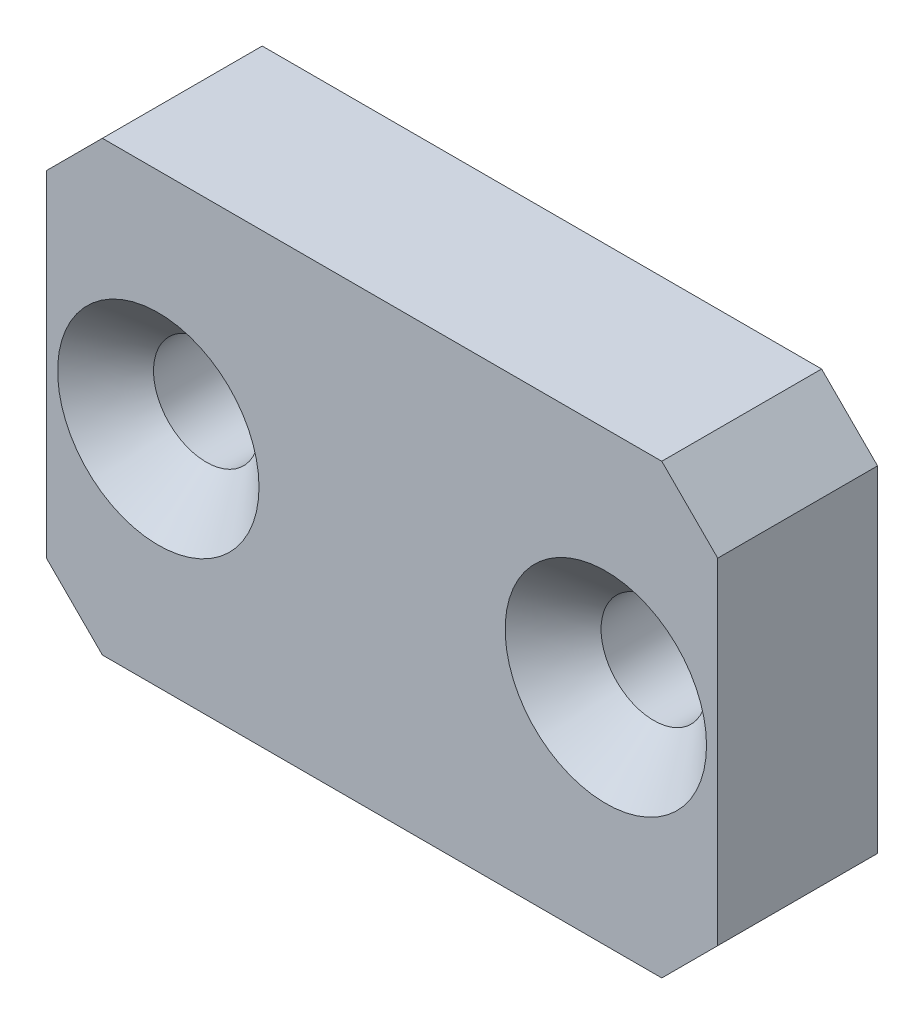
from build123d import *

# Parameters (mm, degrees)
ESQUISSE1_W                                    = 42
ESQUISSE1_H                                    = 28
EXTRUSION1_DEPTH                               = 10
FRAISAGE_POUR_VIS_T_TE_FRAIS_E_M61_D           = 6.6
FRAISAGE_POUR_VIS_T_TE_FRAIS_E_M61_CSINK_D     = 12.6
FRAISAGE_POUR_VIS_T_TE_FRAIS_E_M61_CSINK_ANGLE = 90
CHANFREIN1_SIZE                                = 3.5


with BuildPart() as part:
    # Esquisse1 → Extrusion1 (new body)
    with BuildSketch(Plane.XY):
        Rectangle(ESQUISSE1_W, ESQUISSE1_H)
    extrude(amount=EXTRUSION1_DEPTH)

    # Fraisage pour vis _ t_te frais_e M61 (through all)
    with Locations(Plane.XY.offset(10)):
        with Locations((-14, 0), (14, 0)):
            CounterSinkHole(FRAISAGE_POUR_VIS_T_TE_FRAIS_E_M61_D / 2, FRAISAGE_POUR_VIS_T_TE_FRAIS_E_M61_CSINK_D / 2, counter_sink_angle=FRAISAGE_POUR_VIS_T_TE_FRAIS_E_M61_CSINK_ANGLE)

    # Chanfrein1
    chanfrein1_edges = [part.edges().sort_by_distance(p)[0] for p in [
        (-21, 14, 5),
        (21, 14, 5),
        (21, -14, 5),
        (-21, -14, 5),
    ]]
    chamfer(chanfrein1_edges, length=CHANFREIN1_SIZE)


solid = part.part
